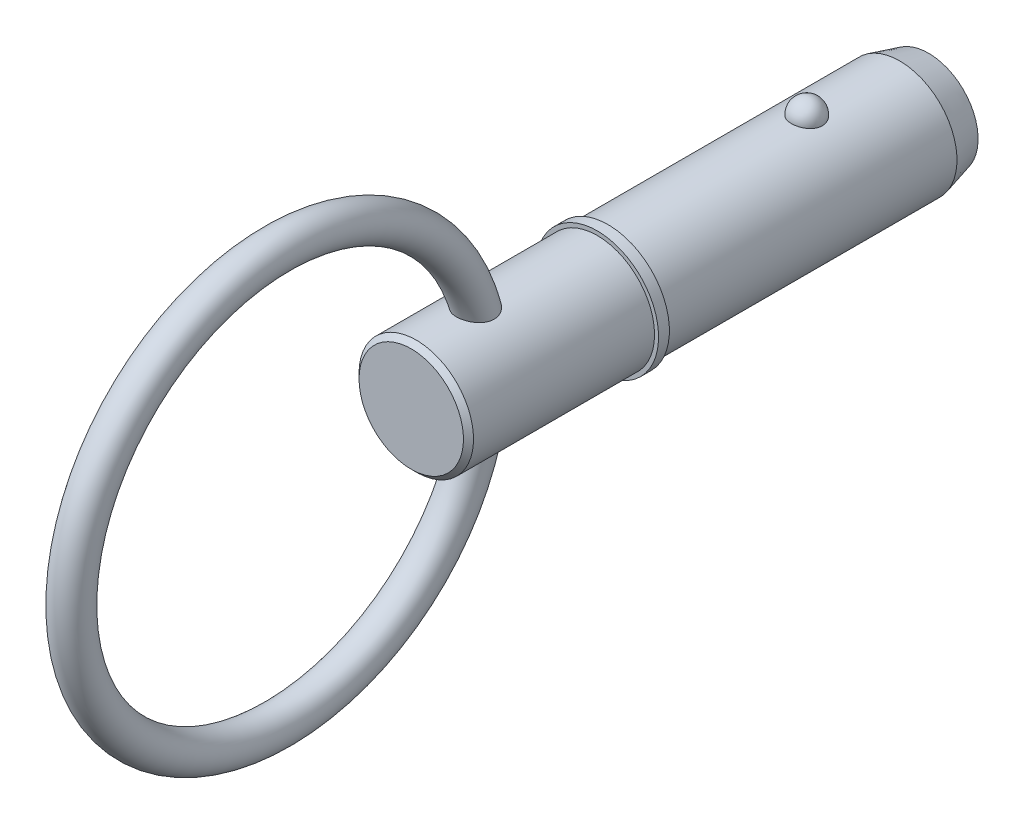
ISO-10303-21;
HEADER;
FILE_DESCRIPTION(('STEP AP214'),'2;1');
FILE_NAME('part.step','',(''),(''),'','','');
FILE_SCHEMA(('AUTOMOTIVE_DESIGN { 1 0 10303 214 1 1 1 1 }'));
ENDSEC;
DATA;
#1=APPLICATION_CONTEXT('core data for automotive mechanical design processes');
#2=APPLICATION_PROTOCOL_DEFINITION('international standard','automotive_design',2000,#1);
#3=PRODUCT_CONTEXT('',#1,'mechanical');
#4=PRODUCT('Part','Part','',(#3));
#5=PRODUCT_RELATED_PRODUCT_CATEGORY('part','',(#4));
#6=PRODUCT_DEFINITION_FORMATION('','',#4);
#7=PRODUCT_DEFINITION_CONTEXT('part definition',#1,'design');
#8=PRODUCT_DEFINITION('design','',#6,#7);
#9=PRODUCT_DEFINITION_SHAPE('','',#8);
#10=(LENGTH_UNIT() NAMED_UNIT(*) SI_UNIT(.MILLI.,.METRE.));
#11=(NAMED_UNIT(*) PLANE_ANGLE_UNIT() SI_UNIT($,.RADIAN.));
#12=(NAMED_UNIT(*) SI_UNIT($,.STERADIAN.) SOLID_ANGLE_UNIT());
#13=UNCERTAINTY_MEASURE_WITH_UNIT(LENGTH_MEASURE(1.E-05),#10,'distance_accuracy_value','');
#14=(GEOMETRIC_REPRESENTATION_CONTEXT(3) GLOBAL_UNCERTAINTY_ASSIGNED_CONTEXT((#13)) GLOBAL_UNIT_ASSIGNED_CONTEXT((#10,
#11,#12)) REPRESENTATION_CONTEXT('',''));
#15=CARTESIAN_POINT('',(0.,0.,0.));
#16=DIRECTION('',(0.,0.,1.));
#17=DIRECTION('',(1.,0.,0.));
#18=AXIS2_PLACEMENT_3D('',#15,#16,#17);
#19=CARTESIAN_POINT('',(0.,0.,25.4));
#20=DIRECTION('',(0.,0.,-1.));
#21=DIRECTION('',(-1.,0.,0.));
#22=AXIS2_PLACEMENT_3D('',#19,#20,#21);
#23=CYLINDRICAL_SURFACE('',#22,7.94);
#24=CARTESIAN_POINT('',(2.13020349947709,7.64891057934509,-2.15000000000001));
#25=CARTESIAN_POINT('',(2.1302012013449,7.64891247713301,-2.0297816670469));
#26=CARTESIAN_POINT('',(2.12037546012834,7.65166842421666,-1.90953383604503));
#27=CARTESIAN_POINT('',(2.08130792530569,7.66238579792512,-1.67243962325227));
#28=CARTESIAN_POINT('',(2.05205785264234,7.67034944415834,-1.55559471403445));
#29=CARTESIAN_POINT('',(1.97489181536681,7.69057749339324,-1.32869361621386));
#30=CARTESIAN_POINT('',(1.92698409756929,7.70283999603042,-1.21863445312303));
#31=CARTESIAN_POINT('',(1.81370645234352,7.73029430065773,-1.00831338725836));
#32=CARTESIAN_POINT('',(1.74833715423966,7.7454859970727,-0.908051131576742));
#33=CARTESIAN_POINT('',(1.60144242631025,7.77718699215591,-0.719628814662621));
#34=CARTESIAN_POINT('',(1.51984382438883,7.7937020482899,-0.631526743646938));
#35=CARTESIAN_POINT('',(1.34279837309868,7.82614685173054,-0.470411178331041));
#36=CARTESIAN_POINT('',(1.24735148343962,7.84207659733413,-0.397397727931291));
#37=CARTESIAN_POINT('',(1.04544839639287,7.87153116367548,-0.268681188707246));
#38=CARTESIAN_POINT('',(0.939022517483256,7.88506234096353,-0.212932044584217));
#39=CARTESIAN_POINT('',(0.717931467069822,7.90825597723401,-0.120080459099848));
#40=CARTESIAN_POINT('',(0.603267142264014,7.9179188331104,-0.0829761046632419));
#41=CARTESIAN_POINT('',(0.371015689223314,7.93216561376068,-0.028959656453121));
#42=CARTESIAN_POINT('',(0.253510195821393,7.93683225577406,-0.011718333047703));
#43=CARTESIAN_POINT('',(0.0171784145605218,7.94086051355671,0.00318921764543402));
#44=CARTESIAN_POINT('',(-0.101647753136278,7.94022260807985,0.00085721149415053));
#45=CARTESIAN_POINT('',(-0.335567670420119,7.93375751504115,-0.0231465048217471));
#46=CARTESIAN_POINT('',(-0.450690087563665,7.92799987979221,-0.0445590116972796));
#47=CARTESIAN_POINT('',(-0.675610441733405,7.91200792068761,-0.105760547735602));
#48=CARTESIAN_POINT('',(-0.785408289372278,7.90177352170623,-0.145549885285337));
#49=CARTESIAN_POINT('',(-0.9972706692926,7.87784802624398,-0.242675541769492));
#50=CARTESIAN_POINT('',(-1.0992893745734,7.86413823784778,-0.30010711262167));
#51=CARTESIAN_POINT('',(-1.29223659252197,7.83474718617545,-0.430887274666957));
#52=CARTESIAN_POINT('',(-1.38316404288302,7.81906573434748,-0.504237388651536));
#53=CARTESIAN_POINT('',(-1.55313516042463,7.78710451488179,-0.666358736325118));
#54=CARTESIAN_POINT('',(-1.63193689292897,7.77081906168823,-0.755382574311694));
#55=CARTESIAN_POINT('',(-1.77366356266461,7.73970270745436,-0.945507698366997));
#56=CARTESIAN_POINT('',(-1.83658745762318,7.72487190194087,-1.04660977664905));
#57=CARTESIAN_POINT('',(-1.94556640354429,7.6981535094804,-1.25927689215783));
#58=CARTESIAN_POINT('',(-1.99143480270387,7.6862989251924,-1.37094182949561));
#59=CARTESIAN_POINT('',(-2.06418311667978,7.66708387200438,-1.60066153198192));
#60=CARTESIAN_POINT('',(-2.0910635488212,7.65972328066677,-1.71871612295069));
#61=CARTESIAN_POINT('',(-2.1250850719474,7.65035479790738,-1.95736076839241));
#62=CARTESIAN_POINT('',(-2.13230490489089,7.64832555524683,-2.07793875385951));
#63=CARTESIAN_POINT('',(-2.12704767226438,7.64978921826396,-2.31862835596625));
#64=CARTESIAN_POINT('',(-2.11457109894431,7.6532819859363,-2.43873998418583));
#65=CARTESIAN_POINT('',(-2.07034166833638,7.66536368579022,-2.67451689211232));
#66=CARTESIAN_POINT('',(-2.03867758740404,7.67392914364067,-2.79020005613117));
#67=CARTESIAN_POINT('',(-1.95694065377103,7.69517736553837,-3.01446692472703));
#68=CARTESIAN_POINT('',(-1.90686710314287,7.70786028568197,-3.12305035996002));
#69=CARTESIAN_POINT('',(-1.78925555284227,7.73600831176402,-3.3306597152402));
#70=CARTESIAN_POINT('',(-1.72162904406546,7.75148739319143,-3.42963360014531));
#71=CARTESIAN_POINT('',(-1.57074739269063,7.78346215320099,-3.61466914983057));
#72=CARTESIAN_POINT('',(-1.48749169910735,7.79995786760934,-3.70073035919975));
#73=CARTESIAN_POINT('',(-1.30720250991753,7.83219119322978,-3.85783594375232));
#74=CARTESIAN_POINT('',(-1.2101234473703,7.84792605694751,-3.92882863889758));
#75=CARTESIAN_POINT('',(-1.00503150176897,7.87681523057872,-4.05342383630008));
#76=CARTESIAN_POINT('',(-0.897019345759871,7.88996971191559,-4.10702749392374));
#77=CARTESIAN_POINT('',(-0.674439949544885,7.91208451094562,-4.19477736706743));
#78=CARTESIAN_POINT('',(-0.559965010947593,7.92109245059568,-4.22914554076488));
#79=CARTESIAN_POINT('',(-0.326625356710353,7.93413878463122,-4.27838865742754));
#80=CARTESIAN_POINT('',(-0.207761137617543,7.93817773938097,-4.29326579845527));
#81=CARTESIAN_POINT('',(0.0287357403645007,7.94081322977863,-4.30300621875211));
#82=CARTESIAN_POINT('',(0.146353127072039,7.93950453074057,-4.29821797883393));
#83=CARTESIAN_POINT('',(0.379062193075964,7.93180098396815,-4.2695522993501));
#84=CARTESIAN_POINT('',(0.49415395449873,7.92540630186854,-4.24567548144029));
#85=CARTESIAN_POINT('',(0.718185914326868,7.90824874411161,-4.17962260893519));
#86=CARTESIAN_POINT('',(0.827145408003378,7.89750055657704,-4.13750805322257));
#87=CARTESIAN_POINT('',(1.03638036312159,7.87277755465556,-4.03615078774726));
#88=CARTESIAN_POINT('',(1.13665531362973,7.85880255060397,-3.97690707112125));
#89=CARTESIAN_POINT('',(1.32729731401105,7.82887859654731,-3.84189297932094));
#90=CARTESIAN_POINT('',(1.41749828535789,7.81290379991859,-3.76589388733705));
#91=CARTESIAN_POINT('',(1.58397257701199,7.78086330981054,-3.59992466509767));
#92=CARTESIAN_POINT('',(1.66024342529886,7.76479760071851,-3.50995206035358));
#93=CARTESIAN_POINT('',(1.79805631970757,7.73405928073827,-3.31688321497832));
#94=CARTESIAN_POINT('',(1.85933944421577,7.719413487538,-3.21359780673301));
#95=CARTESIAN_POINT('',(1.96397499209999,7.69345992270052,-2.99796163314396));
#96=CARTESIAN_POINT('',(2.00733488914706,7.68215076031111,-2.88561466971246));
#97=CARTESIAN_POINT('',(2.07068045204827,7.66529896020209,-2.66994136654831));
#98=CARTESIAN_POINT('',(2.09296296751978,7.65919990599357,-2.56732606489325));
#99=CARTESIAN_POINT('',(2.12272535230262,7.65100492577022,-2.35981463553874));
#100=CARTESIAN_POINT('',(2.13020550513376,7.64890892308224,-2.25491855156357));
#101=CARTESIAN_POINT('',(2.13020349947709,7.64891057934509,-2.15000000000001));
#102=B_SPLINE_CURVE_WITH_KNOTS('',3,(#24,#25,#26,#27,#28,#29,#30,#31,#32,#33,#34,#35,#36,#37,
#38,#39,#40,#41,#42,#43,#44,#45,#46,#47,#48,#49,#50,#51,#52,#53,#54,#55,#56,#57,#58,#59,#60,#61,
#62,#63,#64,#65,#66,#67,#68,#69,#70,#71,#72,#73,#74,#75,#76,#77,#78,#79,#80,#81,#82,#83,#84,#85,
#86,#87,#88,#89,#90,#91,#92,#93,#94,#95,#96,#97,#98,#99,#100,#101),.UNSPECIFIED.,.T.,.F.,(4,2,2,
2,2,2,2,2,2,2,2,2,2,2,2,2,2,2,2,2,2,2,2,2,2,2,2,2,2,2,2,2,2,2,2,2,2,2,4),(0.,0.360277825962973,
0.720709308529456,1.0809816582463,1.44124102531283,1.80316307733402,2.16508618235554,
2.52603531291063,2.88694740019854,3.24178717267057,3.59659491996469,3.94665496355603,
4.29672088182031,4.64871108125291,5.0007349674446,5.3590619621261,5.71741247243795,
6.07957669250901,6.44173104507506,6.80243279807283,7.16312553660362,7.52216203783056,
7.88121215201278,8.24210915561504,8.60301888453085,8.96514709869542,9.32725124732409,
9.68508606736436,10.0428805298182,10.3943622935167,10.7458326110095,11.0961268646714,
11.4464417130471,11.8018724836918,12.1573662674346,12.5186252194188,12.8797333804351,
13.1941658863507,13.5085923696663),.UNSPECIFIED.);
#103=CARTESIAN_POINT('',(2.13020349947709,7.64891057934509,-2.15000000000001));
#104=VERTEX_POINT('',#103);
#105=EDGE_CURVE('E102',#104,#104,#102,.T.);
#106=ORIENTED_EDGE('',*,*,#105,.T.);
#107=EDGE_LOOP('',(#106));
#108=FACE_BOUND('',#107,.T.);
#109=CARTESIAN_POINT('',(0.,0.,-15.0499999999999));
#110=DIRECTION('',(0.,0.,-1.));
#111=DIRECTION('',(-1.,0.,0.));
#112=AXIS2_PLACEMENT_3D('',#109,#110,#111);
#113=CIRCLE('',#112,7.94);
#114=CARTESIAN_POINT('',(-7.94,0.,-15.0499999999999));
#115=VERTEX_POINT('',#114);
#116=EDGE_CURVE('E109',#115,#115,#113,.F.);
#117=ORIENTED_EDGE('',*,*,#116,.T.);
#118=EDGE_LOOP('',(#117));
#119=FACE_BOUND('',#118,.T.);
#120=CARTESIAN_POINT('',(0.,0.,25.4));
#121=DIRECTION('',(0.,0.,1.));
#122=DIRECTION('',(1.,0.,0.));
#123=AXIS2_PLACEMENT_3D('',#120,#121,#122);
#124=CIRCLE('',#123,7.94);
#125=CARTESIAN_POINT('',(7.94,0.,25.4));
#126=VERTEX_POINT('',#125);
#127=EDGE_CURVE('E107',#126,#126,#124,.T.);
#128=ORIENTED_EDGE('',*,*,#127,.F.);
#129=EDGE_LOOP('',(#128));
#130=FACE_BOUND('',#129,.T.);
#131=ADVANCED_FACE('F39',(#108,#119,#130),#23,.T.);
#132=CARTESIAN_POINT('',(0.,0.,-19.05));
#133=DIRECTION('',(0.,0.,-1.));
#134=DIRECTION('',(-1.,0.,0.));
#135=AXIS2_PLACEMENT_3D('',#132,#133,#134);
#136=PLANE('',#135);
#137=CARTESIAN_POINT('',(0.,0.,-19.05));
#138=DIRECTION('',(0.,0.,-1.));
#139=DIRECTION('',(-1.,0.,0.));
#140=AXIS2_PLACEMENT_3D('',#137,#138,#139);
#141=CIRCLE('',#140,6.86820323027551);
#142=CARTESIAN_POINT('',(-6.86820323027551,0.,-19.05));
#143=VERTEX_POINT('',#142);
#144=EDGE_CURVE('E142',#143,#143,#141,.T.);
#145=ORIENTED_EDGE('',*,*,#144,.T.);
#146=EDGE_LOOP('',(#145));
#147=FACE_BOUND('',#146,.T.);
#148=ADVANCED_FACE('F88',(#147),#136,.T.);
#149=CARTESIAN_POINT('',(0.,0.,-19.05));
#150=DIRECTION('',(0.,0.,1.));
#151=DIRECTION('',(1.,0.,0.));
#152=AXIS2_PLACEMENT_3D('',#149,#150,#151);
#153=CONICAL_SURFACE('',#152,6.86820323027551,0.261799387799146);
#154=ORIENTED_EDGE('',*,*,#116,.F.);
#155=EDGE_LOOP('',(#154));
#156=FACE_BOUND('',#155,.T.);
#157=ORIENTED_EDGE('',*,*,#144,.F.);
#158=EDGE_LOOP('',(#157));
#159=FACE_BOUND('',#158,.T.);
#160=ADVANCED_FACE('F94',(#156,#159),#153,.T.);
#161=CARTESIAN_POINT('',(0.,7.94,-2.15000000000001));
#162=DIRECTION('',(0.,1.,0.));
#163=DIRECTION('',(0.,0.,-1.));
#164=AXIS2_PLACEMENT_3D('',#161,#162,#163);
#165=SPHERICAL_SURFACE('',#164,2.15);
#166=ORIENTED_EDGE('',*,*,#105,.F.);
#167=EDGE_LOOP('',(#166));
#168=FACE_BOUND('',#167,.T.);
#169=ADVANCED_FACE('F112',(#168),#165,.T.);
#170=CARTESIAN_POINT('',(0.,0.,25.4));
#171=DIRECTION('',(0.,0.,-1.));
#172=DIRECTION('',(-1.,0.,0.));
#173=AXIS2_PLACEMENT_3D('',#170,#171,#172);
#174=PLANE('',#173);
#175=ORIENTED_EDGE('',*,*,#127,.T.);
#176=EDGE_LOOP('',(#175));
#177=FACE_BOUND('',#176,.T.);
#178=CARTESIAN_POINT('',(0.,0.,25.4));
#179=DIRECTION('',(0.,0.,-1.));
#180=DIRECTION('',(-1.,0.,0.));
#181=AXIS2_PLACEMENT_3D('',#178,#179,#180);
#182=CIRCLE('',#181,8.5);
#183=CARTESIAN_POINT('',(-8.5,0.,25.4));
#184=VERTEX_POINT('',#183);
#185=EDGE_CURVE('E108',#184,#184,#182,.T.);
#186=ORIENTED_EDGE('',*,*,#185,.T.);
#187=EDGE_LOOP('',(#186));
#188=FACE_BOUND('',#187,.T.);
#189=ADVANCED_FACE('F116',(#177,#188),#174,.T.);
#190=CARTESIAN_POINT('',(0.,0.,33.7287874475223));
#191=DIRECTION('',(0.,0.,-1.));
#192=DIRECTION('',(-1.,0.,0.));
#193=AXIS2_PLACEMENT_3D('',#190,#191,#192);
#194=CYLINDRICAL_SURFACE('',#193,8.5);
#195=CARTESIAN_POINT('',(0.,0.,26.9));
#196=DIRECTION('',(0.,0.,-1.));
#197=DIRECTION('',(-1.,0.,0.));
#198=AXIS2_PLACEMENT_3D('',#195,#196,#197);
#199=CIRCLE('',#198,8.5);
#200=CARTESIAN_POINT('',(-8.5,0.,26.9));
#201=VERTEX_POINT('',#200);
#202=EDGE_CURVE('E133',#201,#201,#199,.T.);
#203=ORIENTED_EDGE('',*,*,#202,.T.);
#204=EDGE_LOOP('',(#203));
#205=FACE_BOUND('',#204,.T.);
#206=ORIENTED_EDGE('',*,*,#185,.F.);
#207=EDGE_LOOP('',(#206));
#208=FACE_BOUND('',#207,.T.);
#209=ADVANCED_FACE('F120',(#205,#208),#194,.T.);
#210=CARTESIAN_POINT('',(0.,8.5,26.9));
#211=DIRECTION('',(0.,0.,1.));
#212=DIRECTION('',(1.,0.,0.));
#213=AXIS2_PLACEMENT_3D('',#210,#211,#212);
#214=PLANE('',#213);
#215=CARTESIAN_POINT('',(0.,0.,26.9));
#216=DIRECTION('',(0.,0.,1.));
#217=DIRECTION('',(1.,0.,0.));
#218=AXIS2_PLACEMENT_3D('',#215,#216,#217);
#219=CIRCLE('',#218,7.94);
#220=CARTESIAN_POINT('',(7.94,0.,26.9));
#221=VERTEX_POINT('',#220);
#222=EDGE_CURVE('E111',#221,#221,#219,.T.);
#223=ORIENTED_EDGE('',*,*,#222,.F.);
#224=EDGE_LOOP('',(#223));
#225=FACE_BOUND('',#224,.T.);
#226=ORIENTED_EDGE('',*,*,#202,.F.);
#227=EDGE_LOOP('',(#226));
#228=FACE_BOUND('',#227,.T.);
#229=ADVANCED_FACE('F85',(#225,#228),#214,.T.);
#230=CARTESIAN_POINT('',(0.,0.,52.71));
#231=DIRECTION('',(0.,0.,-1.));
#232=DIRECTION('',(-1.,0.,0.));
#233=AXIS2_PLACEMENT_3D('',#230,#231,#232);
#234=CYLINDRICAL_SURFACE('',#233,7.94);
#235=CARTESIAN_POINT('',(-1.15544091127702,-7.85547938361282,41.511910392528));
#236=CARTESIAN_POINT('',(-1.03089695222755,-7.87379554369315,41.4496153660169));
#237=CARTESIAN_POINT('',(-0.900845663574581,-7.8898743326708,41.3975936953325));
#238=CARTESIAN_POINT('',(-0.633417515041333,-7.91583465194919,41.315265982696));
#239=CARTESIAN_POINT('',(-0.49603783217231,-7.92571377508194,41.2849683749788));
#240=CARTESIAN_POINT('',(-0.217881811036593,-7.93823020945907,41.2467734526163));
#241=CARTESIAN_POINT('',(-0.0771057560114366,-7.94086812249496,41.2388742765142));
#242=CARTESIAN_POINT('',(0.203828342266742,-7.93862624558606,41.2456489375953));
#243=CARTESIAN_POINT('',(0.343986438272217,-7.93374711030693,41.2603208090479));
#244=CARTESIAN_POINT('',(0.619544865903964,-7.9169944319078,41.3118776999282));
#245=CARTESIAN_POINT('',(0.75495076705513,-7.9051293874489,41.348735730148));
#246=CARTESIAN_POINT('',(1.0173752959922,-7.8756583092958,41.4438425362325));
#247=CARTESIAN_POINT('',(1.14439334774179,-7.85805188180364,41.5020927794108));
#248=CARTESIAN_POINT('',(1.38668443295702,-7.81893907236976,41.6388428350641));
#249=CARTESIAN_POINT('',(1.50193494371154,-7.79742542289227,41.7173804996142));
#250=CARTESIAN_POINT('',(1.71711272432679,-7.75288428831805,41.8928724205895));
#251=CARTESIAN_POINT('',(1.81704089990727,-7.72985689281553,41.9898255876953));
#252=CARTESIAN_POINT('',(1.99787261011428,-7.68509802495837,42.1988714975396));
#253=CARTESIAN_POINT('',(2.07893183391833,-7.66335713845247,42.3108273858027));
#254=CARTESIAN_POINT('',(2.22076589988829,-7.62346723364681,42.5474809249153));
#255=CARTESIAN_POINT('',(2.28154607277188,-7.6053172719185,42.6721752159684));
#256=CARTESIAN_POINT('',(2.38011540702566,-7.57504217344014,42.9276189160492));
#257=CARTESIAN_POINT('',(2.41840843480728,-7.56278621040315,43.0581588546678));
#258=CARTESIAN_POINT('',(2.47363993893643,-7.54490265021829,43.3240951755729));
#259=CARTESIAN_POINT('',(2.49057788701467,-7.53927521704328,43.4594916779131));
#260=CARTESIAN_POINT('',(2.50351014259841,-7.53499042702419,43.7324287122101));
#261=CARTESIAN_POINT('',(2.49933630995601,-7.53638902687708,43.8699777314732));
#262=CARTESIAN_POINT('',(2.47072547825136,-7.54581524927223,44.1426982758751));
#263=CARTESIAN_POINT('',(2.44628184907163,-7.55384504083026,44.2778690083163));
#264=CARTESIAN_POINT('',(2.3758931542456,-7.57629160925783,44.5530857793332));
#265=CARTESIAN_POINT('',(2.32844094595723,-7.5911515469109,44.6927089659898));
#266=CARTESIAN_POINT('',(2.21332780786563,-7.62550828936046,44.9627818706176));
#267=CARTESIAN_POINT('',(2.14565489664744,-7.64500784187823,45.0932260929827));
#268=CARTESIAN_POINT('',(1.98438755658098,-7.68852412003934,45.3537020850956));
#269=CARTESIAN_POINT('',(1.88896913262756,-7.71279219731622,45.4825698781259));
#270=CARTESIAN_POINT('',(1.67743245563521,-7.76154719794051,45.722112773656));
#271=CARTESIAN_POINT('',(1.56130644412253,-7.78603420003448,45.8327810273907));
#272=CARTESIAN_POINT('',(1.31168281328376,-7.83191501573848,46.0301000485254));
#273=CARTESIAN_POINT('',(1.17841631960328,-7.85334315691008,46.1170293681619));
#274=CARTESIAN_POINT('',(0.967442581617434,-7.88116219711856,46.2266577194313));
#275=CARTESIAN_POINT('',(0.895283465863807,-7.88971376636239,46.2597363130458));
#276=CARTESIAN_POINT('',(0.747777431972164,-7.90505596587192,46.3184005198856));
#277=CARTESIAN_POINT('',(0.672431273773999,-7.91184701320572,46.3439879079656));
#278=CARTESIAN_POINT('',(0.530575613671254,-7.92252382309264,46.3839121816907));
#279=CARTESIAN_POINT('',(0.464394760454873,-7.92668987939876,46.399349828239));
#280=CARTESIAN_POINT('',(0.330815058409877,-7.9333870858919,46.4240698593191));
#281=CARTESIAN_POINT('',(0.26341641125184,-7.93591850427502,46.4333532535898));
#282=CARTESIAN_POINT('',(0.128041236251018,-7.93925585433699,46.4455779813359));
#283=CARTESIAN_POINT('',(0.0600650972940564,-7.94006286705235,46.4485232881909));
#284=CARTESIAN_POINT('',(-0.0758408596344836,-7.93992929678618,46.4480336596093));
#285=CARTESIAN_POINT('',(-0.143770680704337,-7.93898884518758,46.4445992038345));
#286=CARTESIAN_POINT('',(-0.330023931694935,-7.93402174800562,46.4264060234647));
#287=CARTESIAN_POINT('',(-0.447720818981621,-7.92820264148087,46.4050608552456));
#288=CARTESIAN_POINT('',(-0.677833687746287,-7.91185818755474,46.3440930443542));
#289=CARTESIAN_POINT('',(-0.790248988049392,-7.90133223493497,46.3044680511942));
#290=CARTESIAN_POINT('',(-1.01082100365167,-7.8762011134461,46.2074365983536));
#291=CARTESIAN_POINT('',(-1.11873674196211,-7.86147932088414,46.149515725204));
#292=CARTESIAN_POINT('',(-1.32464461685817,-7.8294189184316,46.0187556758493));
#293=CARTESIAN_POINT('',(-1.42263264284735,-7.81207923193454,45.9459103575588));
#294=CARTESIAN_POINT('',(-1.62038324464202,-7.77363945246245,45.7765366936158));
#295=CARTESIAN_POINT('',(-1.7184938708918,-7.75235190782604,45.6781231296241));
#296=CARTESIAN_POINT('',(-1.89908721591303,-7.71010284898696,45.4677830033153));
#297=CARTESIAN_POINT('',(-1.98155871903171,-7.68914157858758,45.3558468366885));
#298=CARTESIAN_POINT('',(-2.13974270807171,-7.64674394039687,45.1051085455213));
#299=CARTESIAN_POINT('',(-2.2130402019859,-7.62562536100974,44.9647194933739));
#300=CARTESIAN_POINT('',(-2.33615659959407,-7.58881542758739,44.6732666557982));
#301=CARTESIAN_POINT('',(-2.38596943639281,-7.57312547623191,44.5222001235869));
#302=CARTESIAN_POINT('',(-2.46059473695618,-7.54921618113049,44.2104922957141));
#303=CARTESIAN_POINT('',(-2.48494918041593,-7.54113395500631,44.0497288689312));
#304=CARTESIAN_POINT('',(-2.50480773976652,-7.53456588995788,43.7262447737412));
#305=CARTESIAN_POINT('',(-2.50033692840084,-7.53607171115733,43.5635259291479));
#306=CARTESIAN_POINT('',(-2.46306926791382,-7.54832452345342,43.2571659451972));
#307=CARTESIAN_POINT('',(-2.4329569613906,-7.55819528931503,43.1131623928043));
#308=CARTESIAN_POINT('',(-2.34806892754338,-7.58499431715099,42.8333040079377));
#309=CARTESIAN_POINT('',(-2.29330013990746,-7.60192059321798,42.6974468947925));
#310=CARTESIAN_POINT('',(-2.16523724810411,-7.63933506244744,42.4476573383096));
#311=CARTESIAN_POINT('',(-2.09353456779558,-7.65948502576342,42.3328530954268));
#312=CARTESIAN_POINT('',(-1.93200913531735,-7.7018104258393,42.1172680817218));
#313=CARTESIAN_POINT('',(-1.84219262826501,-7.72398516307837,42.0164824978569));
#314=CARTESIAN_POINT('',(-1.65746337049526,-7.76558957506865,41.8413148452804));
#315=CARTESIAN_POINT('',(-1.56413624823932,-7.78505810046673,41.7652591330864));
#316=CARTESIAN_POINT('',(-1.36706423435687,-7.82207051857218,41.6275357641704));
#317=CARTESIAN_POINT('',(-1.26331856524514,-7.83961426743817,41.5658691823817));
#318=CARTESIAN_POINT('',(-1.15544091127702,-7.85547938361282,41.511910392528));
#319=B_SPLINE_CURVE_WITH_KNOTS('',3,(#235,#236,#237,#238,#239,#240,#241,#242,#243,#244,#245,
#246,#247,#248,#249,#250,#251,#252,#253,#254,#255,#256,#257,#258,#259,#260,#261,#262,#263,#264,
#265,#266,#267,#268,#269,#270,#271,#272,#273,#274,#275,#276,#277,#278,#279,#280,#281,#282,#283,
#284,#285,#286,#287,#288,#289,#290,#291,#292,#293,#294,#295,#296,#297,#298,#299,#300,#301,#302,
#303,#304,#305,#306,#307,#308,#309,#310,#311,#312,#313,#314,#315,#316,#317,#318),.UNSPECIFIED.,
.T.,.F.,(4,2,2,2,2,2,2,2,2,2,2,2,2,2,2,2,2,2,2,2,2,2,2,2,2,2,2,2,2,2,2,2,2,2,2,2,2,2,2,2,2,4),
(0.,0.420927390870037,0.842018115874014,1.26307384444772,1.68409290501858,2.1046008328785,
2.52513760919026,2.94646475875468,3.36776699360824,3.78545897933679,4.20304108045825,
4.61086922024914,5.0187074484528,5.42979890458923,5.84102487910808,6.2838331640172,
6.72690434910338,7.21113455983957,7.69554657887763,8.17400305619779,8.41316278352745,
8.65226580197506,8.85622998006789,9.06016068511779,9.26396350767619,9.46775100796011,
9.82521046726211,10.1827159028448,10.5513335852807,10.9201032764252,11.3402098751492,
11.7606166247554,12.2377707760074,12.715048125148,13.2007716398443,13.6860727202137,
14.1260485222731,14.5659005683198,14.9745225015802,15.3830037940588,15.7475760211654,
16.1121754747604),.UNSPECIFIED.);
#320=CARTESIAN_POINT('',(-1.15544091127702,-7.85547938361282,41.511910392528));
#321=VERTEX_POINT('',#320);
#322=EDGE_CURVE('E10',#321,#321,#319,.T.);
#323=ORIENTED_EDGE('',*,*,#322,.F.);
#324=EDGE_LOOP('',(#323));
#325=FACE_BOUND('',#324,.T.);
#326=CARTESIAN_POINT('',(-1.15544091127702,7.85547938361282,41.511910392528));
#327=CARTESIAN_POINT('',(-1.278579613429,7.83736699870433,41.5735072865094));
#328=CARTESIAN_POINT('',(-1.39638360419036,7.8170599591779,41.6451720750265));
#329=CARTESIAN_POINT('',(-1.61803025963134,7.77421032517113,41.8070825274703));
#330=CARTESIAN_POINT('',(-1.72186951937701,7.7516671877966,41.8973327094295));
#331=CARTESIAN_POINT('',(-1.9126968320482,7.70680387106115,42.0943958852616));
#332=CARTESIAN_POINT('',(-1.99967065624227,7.68448389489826,42.2012227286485));
#333=CARTESIAN_POINT('',(-2.15412555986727,7.64262858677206,42.4286078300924));
#334=CARTESIAN_POINT('',(-2.2216118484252,7.62309251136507,42.5491624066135));
#335=CARTESIAN_POINT('',(-2.3342927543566,7.5893410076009,42.798377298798));
#336=CARTESIAN_POINT('',(-2.37985628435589,7.57503857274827,42.9268591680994));
#337=CARTESIAN_POINT('',(-2.44955571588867,7.55278941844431,43.190011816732));
#338=CARTESIAN_POINT('',(-2.47369226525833,7.544842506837,43.3246824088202));
#339=CARTESIAN_POINT('',(-2.50059611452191,7.53596831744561,43.5961377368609));
#340=CARTESIAN_POINT('',(-2.50339277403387,7.53503139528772,43.7329193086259));
#341=CARTESIAN_POINT('',(-2.48855779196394,7.53994222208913,44.0052240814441));
#342=CARTESIAN_POINT('',(-2.47092012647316,7.54579197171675,44.1407468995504));
#343=CARTESIAN_POINT('',(-2.41469361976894,7.56397908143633,44.4162931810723));
#344=CARTESIAN_POINT('',(-2.37479606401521,7.57671999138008,44.5560213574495));
#345=CARTESIAN_POINT('',(-2.27489955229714,7.60730881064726,44.8275158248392));
#346=CARTESIAN_POINT('',(-2.21489004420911,7.6251594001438,44.9592778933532));
#347=CARTESIAN_POINT('',(-2.06943931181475,7.66598084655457,45.2245250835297));
#348=CARTESIAN_POINT('',(-1.98208275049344,7.68928197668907,45.3569147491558));
#349=CARTESIAN_POINT('',(-1.78658869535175,7.73704343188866,45.6052357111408));
#350=CARTESIAN_POINT('',(-1.67843905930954,7.76150442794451,45.721157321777));
#351=CARTESIAN_POINT('',(-1.44142605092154,7.80900750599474,45.9336999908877));
#352=CARTESIAN_POINT('',(-1.31231821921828,7.83202775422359,46.0300586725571));
#353=CARTESIAN_POINT('',(-1.10627655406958,7.86286215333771,46.1546145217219));
#354=CARTESIAN_POINT('',(-1.03552563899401,7.87252500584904,46.1928053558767));
#355=CARTESIAN_POINT('',(-0.890375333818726,7.89025728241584,46.2618851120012));
#356=CARTESIAN_POINT('',(-0.815978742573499,7.89832790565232,46.2927795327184));
#357=CARTESIAN_POINT('',(-0.674180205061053,7.91160332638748,46.3430828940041));
#358=CARTESIAN_POINT('',(-0.607145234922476,7.91704543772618,46.363468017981));
#359=CARTESIAN_POINT('',(-0.471385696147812,7.92628663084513,46.3978763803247));
#360=CARTESIAN_POINT('',(-0.402662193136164,7.93008672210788,46.4119035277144));
#361=CARTESIAN_POINT('',(-0.264153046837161,7.9359070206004,46.433322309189));
#362=CARTESIAN_POINT('',(-0.194368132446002,7.9379283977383,46.4407183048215));
#363=CARTESIAN_POINT('',(-0.0544054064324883,7.940122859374,46.4487430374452));
#364=CARTESIAN_POINT('',(0.0157723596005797,7.94029615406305,46.4493725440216));
#365=CARTESIAN_POINT('',(0.206295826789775,7.93822912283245,46.4418250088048));
#366=CARTESIAN_POINT('',(0.326425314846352,7.93416340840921,46.4269891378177));
#367=CARTESIAN_POINT('',(0.562310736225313,7.92094769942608,46.3780777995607));
#368=CARTESIAN_POINT('',(0.678066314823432,7.91179729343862,46.34400077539));
#369=CARTESIAN_POINT('',(0.9030298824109,7.88929555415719,46.2582699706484));
#370=CARTESIAN_POINT('',(1.01220356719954,7.87592415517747,46.2065321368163));
#371=CARTESIAN_POINT('',(1.22142047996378,7.84620431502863,46.0877939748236));
#372=CARTESIAN_POINT('',(1.32146048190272,7.82985482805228,46.0207882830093));
#373=CARTESIAN_POINT('',(1.52328754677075,7.7932678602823,45.8643092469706));
#374=CARTESIAN_POINT('',(1.6236508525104,7.77280069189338,45.7730560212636));
#375=CARTESIAN_POINT('',(1.80985117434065,7.73156849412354,45.5768153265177));
#376=CARTESIAN_POINT('',(1.895678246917,7.71080327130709,45.4718185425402));
#377=CARTESIAN_POINT('',(2.06302404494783,7.66785771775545,45.2345434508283));
#378=CARTESIAN_POINT('',(2.14213178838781,7.64590590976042,45.1005149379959));
#379=CARTESIAN_POINT('',(2.27825755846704,7.60645646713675,44.8209949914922));
#380=CARTESIAN_POINT('',(2.33526577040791,7.58896081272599,44.6754984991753));
#381=CARTESIAN_POINT('',(2.42707573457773,7.56011538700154,44.3702423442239));
#382=CARTESIAN_POINT('',(2.4608459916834,7.54905411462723,44.2101404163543));
#383=CARTESIAN_POINT('',(2.49980168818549,7.53624914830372,43.8861292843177));
#384=CARTESIAN_POINT('',(2.50500938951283,7.5344981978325,43.7222231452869));
#385=CARTESIAN_POINT('',(2.48594104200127,7.54080673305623,43.4099762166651));
#386=CARTESIAN_POINT('',(2.46407777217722,7.54806351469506,43.2614732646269));
#387=CARTESIAN_POINT('',(2.3945479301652,7.57040718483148,42.971258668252));
#388=CARTESIAN_POINT('',(2.34689355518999,7.58549037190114,42.8295438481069));
#389=CARTESIAN_POINT('',(2.2318274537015,7.62009243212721,42.5691410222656));
#390=CARTESIAN_POINT('',(2.16637710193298,7.63914093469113,42.4495179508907));
#391=CARTESIAN_POINT('',(2.01638736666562,7.68009146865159,42.2234609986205));
#392=CARTESIAN_POINT('',(1.93184850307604,7.7019934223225,42.1170267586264));
#393=CARTESIAN_POINT('',(1.74664202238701,7.74608439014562,41.9206697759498));
#394=CARTESIAN_POINT('',(1.64607913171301,7.76827073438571,41.8306474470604));
#395=CARTESIAN_POINT('',(1.43119791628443,7.81071401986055,41.6683086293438));
#396=CARTESIAN_POINT('',(1.31687846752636,7.83097080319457,41.5959935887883));
#397=CARTESIAN_POINT('',(1.07477437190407,7.86789551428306,41.4691492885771));
#398=CARTESIAN_POINT('',(0.946739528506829,7.88446964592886,41.4150698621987));
#399=CARTESIAN_POINT('',(0.68302989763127,7.91167708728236,41.3282136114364));
#400=CARTESIAN_POINT('',(0.547354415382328,7.92230985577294,41.2954387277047));
#401=CARTESIAN_POINT('',(0.271066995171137,7.93658630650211,41.2517309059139));
#402=CARTESIAN_POINT('',(0.130424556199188,7.94017418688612,41.2409723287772));
#403=CARTESIAN_POINT('',(-0.150736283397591,7.93981282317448,41.2420624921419));
#404=CARTESIAN_POINT('',(-0.291254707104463,7.93586558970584,41.253905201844));
#405=CARTESIAN_POINT('',(-0.556023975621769,7.92151946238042,41.2978917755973));
#406=CARTESIAN_POINT('',(-0.680621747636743,7.91171585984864,41.3281668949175));
#407=CARTESIAN_POINT('',(-0.923476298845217,7.88705844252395,41.4067364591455));
#408=CARTESIAN_POINT('',(-1.04173303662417,7.87220459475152,41.4550310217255));
#409=CARTESIAN_POINT('',(-1.15544091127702,7.85547938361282,41.511910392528));
#410=B_SPLINE_CURVE_WITH_KNOTS('',3,(#326,#327,#328,#329,#330,#331,#332,#333,#334,#335,#336,
#337,#338,#339,#340,#341,#342,#343,#344,#345,#346,#347,#348,#349,#350,#351,#352,#353,#354,#355,
#356,#357,#358,#359,#360,#361,#362,#363,#364,#365,#366,#367,#368,#369,#370,#371,#372,#373,#374,
#375,#376,#377,#378,#379,#380,#381,#382,#383,#384,#385,#386,#387,#388,#389,#390,#391,#392,#393,
#394,#395,#396,#397,#398,#399,#400,#401,#402,#403,#404,#405,#406,#407,#408,#409),.UNSPECIFIED.,
.T.,.F.,(4,2,2,2,2,2,2,2,2,2,2,2,2,2,2,2,2,2,2,2,2,2,2,2,2,2,2,2,2,2,2,2,2,2,2,2,2,2,2,2,2,4),
(0.,0.416167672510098,0.832436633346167,1.24905527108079,1.66556244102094,2.0747916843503,
2.48400855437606,2.89266231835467,3.30143658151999,3.73725068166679,4.17329379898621,
4.65204873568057,5.13108409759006,5.61617224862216,5.85876072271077,6.10116578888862,
6.31168904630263,6.52208269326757,6.73233785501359,6.94256910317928,7.30398888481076,
7.66543791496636,8.02863174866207,8.39195337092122,8.801906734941,9.21213940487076,
9.68159903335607,10.1512669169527,10.6406305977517,11.1296128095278,11.5779838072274,
12.0261429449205,12.4372146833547,12.8482752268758,13.256751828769,13.6652618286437,
14.0832160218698,14.5012082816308,14.9224982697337,15.3436758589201,15.72796797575,
16.1122626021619),.UNSPECIFIED.);
#411=CARTESIAN_POINT('',(-1.15544091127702,7.85547938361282,41.511910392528));
#412=VERTEX_POINT('',#411);
#413=EDGE_CURVE('E51',#412,#412,#410,.T.);
#414=ORIENTED_EDGE('',*,*,#413,.F.);
#415=EDGE_LOOP('',(#414));
#416=FACE_BOUND('',#415,.T.);
#417=CARTESIAN_POINT('',(0.,0.,52.01));
#418=DIRECTION('',(0.,0.,-1.));
#419=DIRECTION('',(-1.,0.,0.));
#420=AXIS2_PLACEMENT_3D('',#417,#418,#419);
#421=CIRCLE('',#420,7.94);
#422=CARTESIAN_POINT('',(-7.94,0.,52.01));
#423=VERTEX_POINT('',#422);
#424=EDGE_CURVE('E64',#423,#423,#421,.T.);
#425=ORIENTED_EDGE('',*,*,#424,.T.);
#426=EDGE_LOOP('',(#425));
#427=FACE_BOUND('',#426,.T.);
#428=ORIENTED_EDGE('',*,*,#222,.T.);
#429=EDGE_LOOP('',(#428));
#430=FACE_BOUND('',#429,.T.);
#431=ADVANCED_FACE('F69',(#325,#416,#427,#430),#234,.T.);
#432=CARTESIAN_POINT('',(0.,0.,52.71));
#433=DIRECTION('',(0.,0.,-1.));
#434=DIRECTION('',(-1.,0.,0.));
#435=AXIS2_PLACEMENT_3D('',#432,#433,#434);
#436=PLANE('',#435);
#437=CARTESIAN_POINT('',(0.,0.,52.71));
#438=DIRECTION('',(0.,0.,-1.));
#439=DIRECTION('',(-1.,0.,0.));
#440=AXIS2_PLACEMENT_3D('',#437,#438,#439);
#441=CIRCLE('',#440,7.24000000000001);
#442=CARTESIAN_POINT('',(-7.24000000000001,0.,52.71));
#443=VERTEX_POINT('',#442);
#444=EDGE_CURVE('E58',#443,#443,#441,.F.);
#445=ORIENTED_EDGE('',*,*,#444,.T.);
#446=EDGE_LOOP('',(#445));
#447=FACE_BOUND('',#446,.T.);
#448=ADVANCED_FACE('F76',(#447),#436,.F.);
#449=CARTESIAN_POINT('',(0.,0.,52.01));
#450=DIRECTION('',(0.,0.,-1.));
#451=DIRECTION('',(-1.,0.,0.));
#452=AXIS2_PLACEMENT_3D('',#449,#450,#451);
#453=CONICAL_SURFACE('',#452,7.94,0.785398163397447);
#454=ORIENTED_EDGE('',*,*,#444,.F.);
#455=EDGE_LOOP('',(#454));
#456=FACE_BOUND('',#455,.T.);
#457=ORIENTED_EDGE('',*,*,#424,.F.);
#458=EDGE_LOOP('',(#457));
#459=FACE_BOUND('',#458,.T.);
#460=ADVANCED_FACE('F41',(#456,#459),#453,.T.);
#461=CARTESIAN_POINT('',(0.,0.,71.285));
#462=DIRECTION('',(1.,0.,0.));
#463=DIRECTION('',(0.,0.,-1.));
#464=AXIS2_PLACEMENT_3D('',#461,#462,#463);
#465=TOROIDAL_SURFACE('',#464,28.575,2.5);
#466=ORIENTED_EDGE('',*,*,#322,.T.);
#467=EDGE_LOOP('',(#466));
#468=FACE_BOUND('',#467,.T.);
#469=ORIENTED_EDGE('',*,*,#413,.T.);
#470=EDGE_LOOP('',(#469));
#471=FACE_BOUND('',#470,.T.);
#472=ADVANCED_FACE('F73',(#468,#471),#465,.T.);
#473=CLOSED_SHELL('',(#131,#148,#160,#169,#189,#209,#229,#431,#448,#460,#472));
#474=MANIFOLD_SOLID_BREP('B2',#473);
#475=ADVANCED_BREP_SHAPE_REPRESENTATION('',(#18,#474),#14);
#476=SHAPE_DEFINITION_REPRESENTATION(#9,#475);
ENDSEC;
END-ISO-10303-21;
